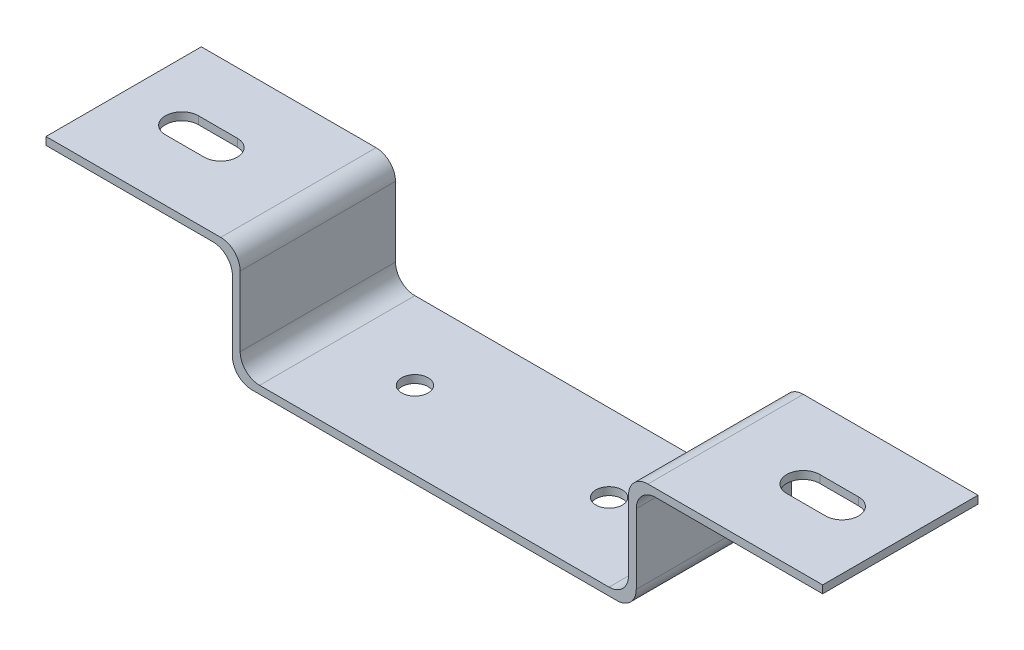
ISO-10303-21;
HEADER;
FILE_DESCRIPTION(('STEP AP214'),'2;1');
FILE_NAME('part.step','',(''),(''),'','','');
FILE_SCHEMA(('AUTOMOTIVE_DESIGN { 1 0 10303 214 1 1 1 1 }'));
ENDSEC;
DATA;
#1=APPLICATION_CONTEXT('core data for automotive mechanical design processes');
#2=APPLICATION_PROTOCOL_DEFINITION('international standard','automotive_design',2000,#1);
#3=PRODUCT_CONTEXT('',#1,'mechanical');
#4=PRODUCT('Part','Part','',(#3));
#5=PRODUCT_RELATED_PRODUCT_CATEGORY('part','',(#4));
#6=PRODUCT_DEFINITION_FORMATION('','',#4);
#7=PRODUCT_DEFINITION_CONTEXT('part definition',#1,'design');
#8=PRODUCT_DEFINITION('design','',#6,#7);
#9=PRODUCT_DEFINITION_SHAPE('','',#8);
#10=(LENGTH_UNIT() NAMED_UNIT(*) SI_UNIT(.MILLI.,.METRE.));
#11=(NAMED_UNIT(*) PLANE_ANGLE_UNIT() SI_UNIT($,.RADIAN.));
#12=(NAMED_UNIT(*) SI_UNIT($,.STERADIAN.) SOLID_ANGLE_UNIT());
#13=UNCERTAINTY_MEASURE_WITH_UNIT(LENGTH_MEASURE(1.E-05),#10,'distance_accuracy_value','');
#14=(GEOMETRIC_REPRESENTATION_CONTEXT(3) GLOBAL_UNCERTAINTY_ASSIGNED_CONTEXT((#13)) GLOBAL_UNIT_ASSIGNED_CONTEXT((#10,
#11,#12)) REPRESENTATION_CONTEXT('',''));
#15=CARTESIAN_POINT('',(0.,0.,0.));
#16=DIRECTION('',(0.,0.,1.));
#17=DIRECTION('',(1.,0.,0.));
#18=AXIS2_PLACEMENT_3D('',#15,#16,#17);
#19=CARTESIAN_POINT('',(0.,0.,40.));
#20=DIRECTION('',(1.,0.,0.));
#21=DIRECTION('',(0.,0.,-1.));
#22=AXIS2_PLACEMENT_3D('',#19,#20,#21);
#23=PLANE('',#22);
#24=DIRECTION('',(0.,-1.,0.));
#25=VECTOR('',#24,1.);
#26=CARTESIAN_POINT('',(0.,0.,0.));
#27=LINE('',#26,#25);
#28=CARTESIAN_POINT('',(0.,0.,0.));
#29=VERTEX_POINT('',#28);
#30=CARTESIAN_POINT('',(0.,-2.,0.));
#31=VERTEX_POINT('',#30);
#32=EDGE_CURVE('E285',#29,#31,#27,.T.);
#33=ORIENTED_EDGE('',*,*,#32,.T.);
#34=DIRECTION('',(0.,0.,-1.));
#35=VECTOR('',#34,1.);
#36=CARTESIAN_POINT('',(0.,-2.,40.));
#37=LINE('',#36,#35);
#38=CARTESIAN_POINT('',(0.,-2.,40.));
#39=VERTEX_POINT('',#38);
#40=EDGE_CURVE('E11',#39,#31,#37,.T.);
#41=ORIENTED_EDGE('',*,*,#40,.F.);
#42=DIRECTION('',(0.,-1.,0.));
#43=VECTOR('',#42,1.);
#44=CARTESIAN_POINT('',(0.,0.,40.));
#45=LINE('',#44,#43);
#46=CARTESIAN_POINT('',(0.,0.,40.));
#47=VERTEX_POINT('',#46);
#48=EDGE_CURVE('E286',#47,#39,#45,.T.);
#49=ORIENTED_EDGE('',*,*,#48,.F.);
#50=DIRECTION('',(0.,0.,-1.));
#51=VECTOR('',#50,1.);
#52=CARTESIAN_POINT('',(0.,0.,40.));
#53=LINE('',#52,#51);
#54=EDGE_CURVE('E328',#47,#29,#53,.T.);
#55=ORIENTED_EDGE('',*,*,#54,.T.);
#56=EDGE_LOOP('',(#33,#41,#49,#55));
#57=FACE_BOUND('',#56,.T.);
#58=ADVANCED_FACE('F33',(#57),#23,.F.);
#59=CARTESIAN_POINT('',(0.,-2.,40.));
#60=DIRECTION('',(0.,1.,0.));
#61=DIRECTION('',(0.,0.,1.));
#62=AXIS2_PLACEMENT_3D('',#59,#60,#61);
#63=PLANE('',#62);
#64=DIRECTION('',(-1.,0.,0.));
#65=VECTOR('',#64,1.);
#66=CARTESIAN_POINT('',(25.,-2.,24.25));
#67=LINE('',#66,#65);
#68=CARTESIAN_POINT('',(25.,-2.,24.2499999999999));
#69=VERTEX_POINT('',#68);
#70=CARTESIAN_POINT('',(15.,-2.,24.2499999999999));
#71=VERTEX_POINT('',#70);
#72=EDGE_CURVE('E240',#69,#71,#67,.T.);
#73=ORIENTED_EDGE('',*,*,#72,.F.);
#74=CARTESIAN_POINT('',(25.,-2.,19.9999999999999));
#75=DIRECTION('',(0.,-1.,0.));
#76=DIRECTION('',(0.,0.,-1.));
#77=AXIS2_PLACEMENT_3D('',#74,#75,#76);
#78=CIRCLE('',#77,4.25);
#79=CARTESIAN_POINT('',(25.,-2.,15.7499999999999));
#80=VERTEX_POINT('',#79);
#81=EDGE_CURVE('E48',#80,#69,#78,.T.);
#82=ORIENTED_EDGE('',*,*,#81,.F.);
#83=DIRECTION('',(1.,0.,0.));
#84=VECTOR('',#83,1.);
#85=CARTESIAN_POINT('',(25.,-2.,15.7499999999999));
#86=LINE('',#85,#84);
#87=CARTESIAN_POINT('',(15.,-2.,15.7499999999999));
#88=VERTEX_POINT('',#87);
#89=EDGE_CURVE('E226',#88,#80,#86,.T.);
#90=ORIENTED_EDGE('',*,*,#89,.F.);
#91=CARTESIAN_POINT('',(15.,-2.,19.9999999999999));
#92=DIRECTION('',(0.,-1.,0.));
#93=DIRECTION('',(0.,0.,-1.));
#94=AXIS2_PLACEMENT_3D('',#91,#92,#93);
#95=CIRCLE('',#94,4.25);
#96=EDGE_CURVE('E246',#71,#88,#95,.T.);
#97=ORIENTED_EDGE('',*,*,#96,.F.);
#98=EDGE_LOOP('',(#73,#82,#90,#97));
#99=FACE_BOUND('',#98,.T.);
#100=DIRECTION('',(1.,0.,0.));
#101=VECTOR('',#100,1.);
#102=CARTESIAN_POINT('',(0.,-2.,0.));
#103=LINE('',#102,#101);
#104=CARTESIAN_POINT('',(43.,-2.,0.));
#105=VERTEX_POINT('',#104);
#106=EDGE_CURVE('E331',#31,#105,#103,.T.);
#107=ORIENTED_EDGE('',*,*,#106,.T.);
#108=DIRECTION('',(0.,0.,-1.));
#109=VECTOR('',#108,1.);
#110=CARTESIAN_POINT('',(43.,-2.,40.));
#111=LINE('',#110,#109);
#112=CARTESIAN_POINT('',(43.,-2.,40.));
#113=VERTEX_POINT('',#112);
#114=EDGE_CURVE('E41',#113,#105,#111,.T.);
#115=ORIENTED_EDGE('',*,*,#114,.F.);
#116=DIRECTION('',(1.,0.,0.));
#117=VECTOR('',#116,1.);
#118=CARTESIAN_POINT('',(0.,-2.,40.));
#119=LINE('',#118,#117);
#120=EDGE_CURVE('E289',#39,#113,#119,.T.);
#121=ORIENTED_EDGE('',*,*,#120,.F.);
#122=ORIENTED_EDGE('',*,*,#40,.T.);
#123=EDGE_LOOP('',(#107,#115,#121,#122));
#124=FACE_BOUND('',#123,.T.);
#125=ADVANCED_FACE('F449',(#99,#124),#63,.F.);
#126=CARTESIAN_POINT('',(43.,-7.,40.));
#127=DIRECTION('',(0.,0.,-1.));
#128=DIRECTION('',(-1.,0.,0.));
#129=AXIS2_PLACEMENT_3D('',#126,#127,#128);
#130=CYLINDRICAL_SURFACE('',#129,5.);
#131=CARTESIAN_POINT('',(43.,-7.,0.));
#132=DIRECTION('',(0.,0.,-1.));
#133=DIRECTION('',(-1.,0.,0.));
#134=AXIS2_PLACEMENT_3D('',#131,#132,#133);
#135=CIRCLE('',#134,5.);
#136=CARTESIAN_POINT('',(48.,-7.,0.));
#137=VERTEX_POINT('',#136);
#138=EDGE_CURVE('E333',#105,#137,#135,.T.);
#139=ORIENTED_EDGE('',*,*,#138,.T.);
#140=DIRECTION('',(0.,0.,-1.));
#141=VECTOR('',#140,1.);
#142=CARTESIAN_POINT('',(48.,-7.,40.));
#143=LINE('',#142,#141);
#144=CARTESIAN_POINT('',(48.,-7.,40.));
#145=VERTEX_POINT('',#144);
#146=EDGE_CURVE('E418',#145,#137,#143,.T.);
#147=ORIENTED_EDGE('',*,*,#146,.F.);
#148=CARTESIAN_POINT('',(43.,-7.,40.));
#149=DIRECTION('',(0.,0.,-1.));
#150=DIRECTION('',(-1.,0.,0.));
#151=AXIS2_PLACEMENT_3D('',#148,#149,#150);
#152=CIRCLE('',#151,5.);
#153=EDGE_CURVE('E292',#113,#145,#152,.T.);
#154=ORIENTED_EDGE('',*,*,#153,.F.);
#155=ORIENTED_EDGE('',*,*,#114,.T.);
#156=EDGE_LOOP('',(#139,#147,#154,#155));
#157=FACE_BOUND('',#156,.T.);
#158=ADVANCED_FACE('F426',(#157),#130,.F.);
#159=CARTESIAN_POINT('',(48.,-7.,40.));
#160=DIRECTION('',(1.,0.,0.));
#161=DIRECTION('',(0.,0.,-1.));
#162=AXIS2_PLACEMENT_3D('',#159,#160,#161);
#163=PLANE('',#162);
#164=DIRECTION('',(0.,-1.,0.));
#165=VECTOR('',#164,1.);
#166=CARTESIAN_POINT('',(48.,-7.,0.));
#167=LINE('',#166,#165);
#168=CARTESIAN_POINT('',(48.,-25.,0.));
#169=VERTEX_POINT('',#168);
#170=EDGE_CURVE('E335',#137,#169,#167,.T.);
#171=ORIENTED_EDGE('',*,*,#170,.T.);
#172=DIRECTION('',(0.,0.,-1.));
#173=VECTOR('',#172,1.);
#174=CARTESIAN_POINT('',(48.,-25.,40.));
#175=LINE('',#174,#173);
#176=CARTESIAN_POINT('',(48.,-25.,40.));
#177=VERTEX_POINT('',#176);
#178=EDGE_CURVE('E415',#177,#169,#175,.T.);
#179=ORIENTED_EDGE('',*,*,#178,.F.);
#180=DIRECTION('',(0.,-1.,0.));
#181=VECTOR('',#180,1.);
#182=CARTESIAN_POINT('',(48.,-7.,40.));
#183=LINE('',#182,#181);
#184=EDGE_CURVE('E294',#145,#177,#183,.T.);
#185=ORIENTED_EDGE('',*,*,#184,.F.);
#186=ORIENTED_EDGE('',*,*,#146,.T.);
#187=EDGE_LOOP('',(#171,#179,#185,#186));
#188=FACE_BOUND('',#187,.T.);
#189=ADVANCED_FACE('F437',(#188),#163,.F.);
#190=CARTESIAN_POINT('',(53.,-25.,40.));
#191=DIRECTION('',(0.,0.,-1.));
#192=DIRECTION('',(-1.,0.,0.));
#193=AXIS2_PLACEMENT_3D('',#190,#191,#192);
#194=CYLINDRICAL_SURFACE('',#193,5.);
#195=CARTESIAN_POINT('',(53.,-25.,0.));
#196=DIRECTION('',(0.,0.,1.));
#197=DIRECTION('',(1.,0.,0.));
#198=AXIS2_PLACEMENT_3D('',#195,#196,#197);
#199=CIRCLE('',#198,5.);
#200=CARTESIAN_POINT('',(53.,-30.,0.));
#201=VERTEX_POINT('',#200);
#202=EDGE_CURVE('E337',#169,#201,#199,.T.);
#203=ORIENTED_EDGE('',*,*,#202,.T.);
#204=DIRECTION('',(0.,0.,-1.));
#205=VECTOR('',#204,1.);
#206=CARTESIAN_POINT('',(53.,-30.,40.));
#207=LINE('',#206,#205);
#208=CARTESIAN_POINT('',(53.,-30.,40.));
#209=VERTEX_POINT('',#208);
#210=EDGE_CURVE('E412',#209,#201,#207,.T.);
#211=ORIENTED_EDGE('',*,*,#210,.F.);
#212=CARTESIAN_POINT('',(53.,-25.,40.));
#213=DIRECTION('',(0.,0.,1.));
#214=DIRECTION('',(1.,0.,0.));
#215=AXIS2_PLACEMENT_3D('',#212,#213,#214);
#216=CIRCLE('',#215,5.);
#217=EDGE_CURVE('E296',#177,#209,#216,.T.);
#218=ORIENTED_EDGE('',*,*,#217,.F.);
#219=ORIENTED_EDGE('',*,*,#178,.T.);
#220=EDGE_LOOP('',(#203,#211,#218,#219));
#221=FACE_BOUND('',#220,.T.);
#222=ADVANCED_FACE('F441',(#221),#194,.T.);
#223=CARTESIAN_POINT('',(53.,-30.,40.));
#224=DIRECTION('',(0.,1.,0.));
#225=DIRECTION('',(-1.,0.,0.));
#226=AXIS2_PLACEMENT_3D('',#223,#224,#225);
#227=PLANE('',#226);
#228=CARTESIAN_POINT('',(75.,-30.,20.));
#229=DIRECTION('',(0.,-1.,0.));
#230=DIRECTION('',(0.,0.,-1.));
#231=AXIS2_PLACEMENT_3D('',#228,#229,#230);
#232=CIRCLE('',#231,3.4);
#233=CARTESIAN_POINT('',(75.,-30.,16.6));
#234=VERTEX_POINT('',#233);
#235=EDGE_CURVE('E791',#234,#234,#232,.T.);
#236=ORIENTED_EDGE('',*,*,#235,.F.);
#237=EDGE_LOOP('',(#236));
#238=FACE_BOUND('',#237,.T.);
#239=CARTESIAN_POINT('',(125.,-30.,20.));
#240=DIRECTION('',(0.,-1.,0.));
#241=DIRECTION('',(0.,0.,-1.));
#242=AXIS2_PLACEMENT_3D('',#239,#240,#241);
#243=CIRCLE('',#242,3.39999999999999);
#244=CARTESIAN_POINT('',(125.,-30.,16.6));
#245=VERTEX_POINT('',#244);
#246=EDGE_CURVE('E795',#245,#245,#243,.T.);
#247=ORIENTED_EDGE('',*,*,#246,.F.);
#248=EDGE_LOOP('',(#247));
#249=FACE_BOUND('',#248,.T.);
#250=DIRECTION('',(1.,0.,0.));
#251=VECTOR('',#250,1.);
#252=CARTESIAN_POINT('',(53.,-30.,0.));
#253=LINE('',#252,#251);
#254=CARTESIAN_POINT('',(147.,-30.,0.));
#255=VERTEX_POINT('',#254);
#256=EDGE_CURVE('E339',#201,#255,#253,.T.);
#257=ORIENTED_EDGE('',*,*,#256,.T.);
#258=DIRECTION('',(0.,0.,-1.));
#259=VECTOR('',#258,1.);
#260=CARTESIAN_POINT('',(147.,-30.,40.));
#261=LINE('',#260,#259);
#262=CARTESIAN_POINT('',(147.,-30.,40.));
#263=VERTEX_POINT('',#262);
#264=EDGE_CURVE('E409',#263,#255,#261,.T.);
#265=ORIENTED_EDGE('',*,*,#264,.F.);
#266=DIRECTION('',(1.,0.,0.));
#267=VECTOR('',#266,1.);
#268=CARTESIAN_POINT('',(53.,-30.,40.));
#269=LINE('',#268,#267);
#270=EDGE_CURVE('E298',#209,#263,#269,.T.);
#271=ORIENTED_EDGE('',*,*,#270,.F.);
#272=ORIENTED_EDGE('',*,*,#210,.T.);
#273=EDGE_LOOP('',(#257,#265,#271,#272));
#274=FACE_BOUND('',#273,.T.);
#275=ADVANCED_FACE('F520',(#238,#249,#274),#227,.F.);
#276=CARTESIAN_POINT('',(147.,-25.,40.));
#277=DIRECTION('',(0.,0.,-1.));
#278=DIRECTION('',(-1.,0.,0.));
#279=AXIS2_PLACEMENT_3D('',#276,#277,#278);
#280=CYLINDRICAL_SURFACE('',#279,5.);
#281=CARTESIAN_POINT('',(147.,-25.,0.));
#282=DIRECTION('',(0.,0.,1.));
#283=DIRECTION('',(1.,0.,0.));
#284=AXIS2_PLACEMENT_3D('',#281,#282,#283);
#285=CIRCLE('',#284,5.);
#286=CARTESIAN_POINT('',(152.,-25.,0.));
#287=VERTEX_POINT('',#286);
#288=EDGE_CURVE('E341',#255,#287,#285,.T.);
#289=ORIENTED_EDGE('',*,*,#288,.T.);
#290=DIRECTION('',(0.,0.,-1.));
#291=VECTOR('',#290,1.);
#292=CARTESIAN_POINT('',(152.,-25.,40.));
#293=LINE('',#292,#291);
#294=CARTESIAN_POINT('',(152.,-25.,40.));
#295=VERTEX_POINT('',#294);
#296=EDGE_CURVE('E406',#295,#287,#293,.T.);
#297=ORIENTED_EDGE('',*,*,#296,.F.);
#298=CARTESIAN_POINT('',(147.,-25.,40.));
#299=DIRECTION('',(0.,0.,1.));
#300=DIRECTION('',(1.,0.,0.));
#301=AXIS2_PLACEMENT_3D('',#298,#299,#300);
#302=CIRCLE('',#301,5.);
#303=EDGE_CURVE('E300',#263,#295,#302,.T.);
#304=ORIENTED_EDGE('',*,*,#303,.F.);
#305=ORIENTED_EDGE('',*,*,#264,.T.);
#306=EDGE_LOOP('',(#289,#297,#304,#305));
#307=FACE_BOUND('',#306,.T.);
#308=ADVANCED_FACE('F518',(#307),#280,.T.);
#309=CARTESIAN_POINT('',(152.,-25.,40.));
#310=DIRECTION('',(-1.,0.,0.));
#311=DIRECTION('',(0.,0.,1.));
#312=AXIS2_PLACEMENT_3D('',#309,#310,#311);
#313=PLANE('',#312);
#314=DIRECTION('',(0.,1.,0.));
#315=VECTOR('',#314,1.);
#316=CARTESIAN_POINT('',(152.,-25.,0.));
#317=LINE('',#316,#315);
#318=CARTESIAN_POINT('',(152.,-7.,0.));
#319=VERTEX_POINT('',#318);
#320=EDGE_CURVE('E343',#287,#319,#317,.T.);
#321=ORIENTED_EDGE('',*,*,#320,.T.);
#322=DIRECTION('',(0.,0.,-1.));
#323=VECTOR('',#322,1.);
#324=CARTESIAN_POINT('',(152.,-7.,40.));
#325=LINE('',#324,#323);
#326=CARTESIAN_POINT('',(152.,-7.,40.));
#327=VERTEX_POINT('',#326);
#328=EDGE_CURVE('E403',#327,#319,#325,.T.);
#329=ORIENTED_EDGE('',*,*,#328,.F.);
#330=DIRECTION('',(0.,1.,0.));
#331=VECTOR('',#330,1.);
#332=CARTESIAN_POINT('',(152.,-25.,40.));
#333=LINE('',#332,#331);
#334=EDGE_CURVE('E302',#295,#327,#333,.T.);
#335=ORIENTED_EDGE('',*,*,#334,.F.);
#336=ORIENTED_EDGE('',*,*,#296,.T.);
#337=EDGE_LOOP('',(#321,#329,#335,#336));
#338=FACE_BOUND('',#337,.T.);
#339=ADVANCED_FACE('F513',(#338),#313,.F.);
#340=CARTESIAN_POINT('',(157.,-7.,40.));
#341=DIRECTION('',(0.,0.,-1.));
#342=DIRECTION('',(-1.,0.,0.));
#343=AXIS2_PLACEMENT_3D('',#340,#341,#342);
#344=CYLINDRICAL_SURFACE('',#343,5.);
#345=CARTESIAN_POINT('',(157.,-7.,0.));
#346=DIRECTION('',(0.,0.,-1.));
#347=DIRECTION('',(1.,0.,0.));
#348=AXIS2_PLACEMENT_3D('',#345,#346,#347);
#349=CIRCLE('',#348,5.);
#350=CARTESIAN_POINT('',(157.,-2.,0.));
#351=VERTEX_POINT('',#350);
#352=EDGE_CURVE('E345',#319,#351,#349,.T.);
#353=ORIENTED_EDGE('',*,*,#352,.T.);
#354=DIRECTION('',(0.,0.,-1.));
#355=VECTOR('',#354,1.);
#356=CARTESIAN_POINT('',(157.,-2.,40.));
#357=LINE('',#356,#355);
#358=CARTESIAN_POINT('',(157.,-2.,40.));
#359=VERTEX_POINT('',#358);
#360=EDGE_CURVE('E400',#359,#351,#357,.T.);
#361=ORIENTED_EDGE('',*,*,#360,.F.);
#362=CARTESIAN_POINT('',(157.,-7.,40.));
#363=DIRECTION('',(0.,0.,-1.));
#364=DIRECTION('',(1.,0.,0.));
#365=AXIS2_PLACEMENT_3D('',#362,#363,#364);
#366=CIRCLE('',#365,5.);
#367=EDGE_CURVE('E304',#327,#359,#366,.T.);
#368=ORIENTED_EDGE('',*,*,#367,.F.);
#369=ORIENTED_EDGE('',*,*,#328,.T.);
#370=EDGE_LOOP('',(#353,#361,#368,#369));
#371=FACE_BOUND('',#370,.T.);
#372=ADVANCED_FACE('F508',(#371),#344,.F.);
#373=CARTESIAN_POINT('',(157.,-2.,40.));
#374=DIRECTION('',(0.,1.,0.));
#375=DIRECTION('',(0.,0.,1.));
#376=AXIS2_PLACEMENT_3D('',#373,#374,#375);
#377=PLANE('',#376);
#378=DIRECTION('',(-1.,0.,0.));
#379=VECTOR('',#378,1.);
#380=CARTESIAN_POINT('',(185.,-2.,24.25));
#381=LINE('',#380,#379);
#382=CARTESIAN_POINT('',(185.,-2.,24.25));
#383=VERTEX_POINT('',#382);
#384=CARTESIAN_POINT('',(175.,-2.,24.25));
#385=VERTEX_POINT('',#384);
#386=EDGE_CURVE('E264',#383,#385,#381,.T.);
#387=ORIENTED_EDGE('',*,*,#386,.F.);
#388=CARTESIAN_POINT('',(185.,-2.,20.));
#389=DIRECTION('',(0.,-1.,0.));
#390=DIRECTION('',(0.,0.,-1.));
#391=AXIS2_PLACEMENT_3D('',#388,#389,#390);
#392=CIRCLE('',#391,4.25);
#393=CARTESIAN_POINT('',(185.,-2.,15.75));
#394=VERTEX_POINT('',#393);
#395=EDGE_CURVE('E262',#394,#383,#392,.T.);
#396=ORIENTED_EDGE('',*,*,#395,.F.);
#397=DIRECTION('',(1.,0.,0.));
#398=VECTOR('',#397,1.);
#399=CARTESIAN_POINT('',(185.,-2.,15.75));
#400=LINE('',#399,#398);
#401=CARTESIAN_POINT('',(175.,-2.,15.75));
#402=VERTEX_POINT('',#401);
#403=EDGE_CURVE('E270',#402,#394,#400,.T.);
#404=ORIENTED_EDGE('',*,*,#403,.F.);
#405=CARTESIAN_POINT('',(175.,-2.,20.));
#406=DIRECTION('',(0.,-1.,0.));
#407=DIRECTION('',(0.,0.,-1.));
#408=AXIS2_PLACEMENT_3D('',#405,#406,#407);
#409=CIRCLE('',#408,4.25);
#410=EDGE_CURVE('E267',#385,#402,#409,.T.);
#411=ORIENTED_EDGE('',*,*,#410,.F.);
#412=EDGE_LOOP('',(#387,#396,#404,#411));
#413=FACE_BOUND('',#412,.T.);
#414=DIRECTION('',(1.,0.,0.));
#415=VECTOR('',#414,1.);
#416=CARTESIAN_POINT('',(157.,-2.,0.));
#417=LINE('',#416,#415);
#418=CARTESIAN_POINT('',(200.,-2.,0.));
#419=VERTEX_POINT('',#418);
#420=EDGE_CURVE('E347',#351,#419,#417,.T.);
#421=ORIENTED_EDGE('',*,*,#420,.T.);
#422=DIRECTION('',(0.,0.,-1.));
#423=VECTOR('',#422,1.);
#424=CARTESIAN_POINT('',(200.,-2.,40.));
#425=LINE('',#424,#423);
#426=CARTESIAN_POINT('',(200.,-2.,40.));
#427=VERTEX_POINT('',#426);
#428=EDGE_CURVE('E397',#427,#419,#425,.T.);
#429=ORIENTED_EDGE('',*,*,#428,.F.);
#430=DIRECTION('',(1.,0.,0.));
#431=VECTOR('',#430,1.);
#432=CARTESIAN_POINT('',(157.,-2.,40.));
#433=LINE('',#432,#431);
#434=EDGE_CURVE('E306',#359,#427,#433,.T.);
#435=ORIENTED_EDGE('',*,*,#434,.F.);
#436=ORIENTED_EDGE('',*,*,#360,.T.);
#437=EDGE_LOOP('',(#421,#429,#435,#436));
#438=FACE_BOUND('',#437,.T.);
#439=ADVANCED_FACE('F504',(#413,#438),#377,.F.);
#440=CARTESIAN_POINT('',(200.,0.,40.));
#441=DIRECTION('',(-1.,0.,0.));
#442=DIRECTION('',(0.,0.,1.));
#443=AXIS2_PLACEMENT_3D('',#440,#441,#442);
#444=PLANE('',#443);
#445=DIRECTION('',(0.,1.,0.));
#446=VECTOR('',#445,1.);
#447=CARTESIAN_POINT('',(200.,0.,0.));
#448=LINE('',#447,#446);
#449=CARTESIAN_POINT('',(200.,0.,0.));
#450=VERTEX_POINT('',#449);
#451=EDGE_CURVE('E349',#419,#450,#448,.T.);
#452=ORIENTED_EDGE('',*,*,#451,.T.);
#453=DIRECTION('',(0.,0.,-1.));
#454=VECTOR('',#453,1.);
#455=CARTESIAN_POINT('',(200.,0.,40.));
#456=LINE('',#455,#454);
#457=CARTESIAN_POINT('',(200.,0.,40.));
#458=VERTEX_POINT('',#457);
#459=EDGE_CURVE('E394',#458,#450,#456,.T.);
#460=ORIENTED_EDGE('',*,*,#459,.F.);
#461=DIRECTION('',(0.,1.,0.));
#462=VECTOR('',#461,1.);
#463=CARTESIAN_POINT('',(200.,0.,40.));
#464=LINE('',#463,#462);
#465=EDGE_CURVE('E308',#427,#458,#464,.T.);
#466=ORIENTED_EDGE('',*,*,#465,.F.);
#467=ORIENTED_EDGE('',*,*,#428,.T.);
#468=EDGE_LOOP('',(#452,#460,#466,#467));
#469=FACE_BOUND('',#468,.T.);
#470=ADVANCED_FACE('F499',(#469),#444,.F.);
#471=CARTESIAN_POINT('',(155.,0.,40.));
#472=DIRECTION('',(0.,-1.,0.));
#473=DIRECTION('',(0.,0.,-1.));
#474=AXIS2_PLACEMENT_3D('',#471,#472,#473);
#475=PLANE('',#474);
#476=DIRECTION('',(-1.,0.,0.));
#477=VECTOR('',#476,1.);
#478=CARTESIAN_POINT('',(185.,0.,15.75));
#479=LINE('',#478,#477);
#480=CARTESIAN_POINT('',(185.,0.,15.75));
#481=VERTEX_POINT('',#480);
#482=CARTESIAN_POINT('',(175.,0.,15.75));
#483=VERTEX_POINT('',#482);
#484=EDGE_CURVE('E256',#481,#483,#479,.T.);
#485=ORIENTED_EDGE('',*,*,#484,.F.);
#486=CARTESIAN_POINT('',(185.,0.,20.));
#487=DIRECTION('',(0.,-1.,0.));
#488=DIRECTION('',(0.,0.,-1.));
#489=AXIS2_PLACEMENT_3D('',#486,#487,#488);
#490=CIRCLE('',#489,4.25);
#491=CARTESIAN_POINT('',(185.,0.,24.25));
#492=VERTEX_POINT('',#491);
#493=EDGE_CURVE('E259',#492,#481,#490,.F.);
#494=ORIENTED_EDGE('',*,*,#493,.F.);
#495=DIRECTION('',(1.,0.,0.));
#496=VECTOR('',#495,1.);
#497=CARTESIAN_POINT('',(185.,0.,24.25));
#498=LINE('',#497,#496);
#499=CARTESIAN_POINT('',(175.,0.,24.25));
#500=VERTEX_POINT('',#499);
#501=EDGE_CURVE('E276',#500,#492,#498,.T.);
#502=ORIENTED_EDGE('',*,*,#501,.F.);
#503=CARTESIAN_POINT('',(175.,0.,20.));
#504=DIRECTION('',(0.,-1.,0.));
#505=DIRECTION('',(0.,0.,-1.));
#506=AXIS2_PLACEMENT_3D('',#503,#504,#505);
#507=CIRCLE('',#506,4.25);
#508=EDGE_CURVE('E232',#483,#500,#507,.F.);
#509=ORIENTED_EDGE('',*,*,#508,.F.);
#510=EDGE_LOOP('',(#485,#494,#502,#509));
#511=FACE_BOUND('',#510,.T.);
#512=DIRECTION('',(-1.,0.,0.));
#513=VECTOR('',#512,1.);
#514=CARTESIAN_POINT('',(155.,0.,0.));
#515=LINE('',#514,#513);
#516=CARTESIAN_POINT('',(155.,0.,0.));
#517=VERTEX_POINT('',#516);
#518=EDGE_CURVE('E351',#450,#517,#515,.T.);
#519=ORIENTED_EDGE('',*,*,#518,.T.);
#520=DIRECTION('',(0.,0.,-1.));
#521=VECTOR('',#520,1.);
#522=CARTESIAN_POINT('',(155.,0.,40.));
#523=LINE('',#522,#521);
#524=CARTESIAN_POINT('',(155.,0.,40.));
#525=VERTEX_POINT('',#524);
#526=EDGE_CURVE('E391',#525,#517,#523,.T.);
#527=ORIENTED_EDGE('',*,*,#526,.F.);
#528=DIRECTION('',(-1.,0.,0.));
#529=VECTOR('',#528,1.);
#530=CARTESIAN_POINT('',(155.,0.,40.));
#531=LINE('',#530,#529);
#532=EDGE_CURVE('E310',#458,#525,#531,.T.);
#533=ORIENTED_EDGE('',*,*,#532,.F.);
#534=ORIENTED_EDGE('',*,*,#459,.T.);
#535=EDGE_LOOP('',(#519,#527,#533,#534));
#536=FACE_BOUND('',#535,.T.);
#537=ADVANCED_FACE('F493',(#511,#536),#475,.F.);
#538=CARTESIAN_POINT('',(155.,-5.,40.));
#539=DIRECTION('',(0.,0.,-1.));
#540=DIRECTION('',(-1.,0.,0.));
#541=AXIS2_PLACEMENT_3D('',#538,#539,#540);
#542=CYLINDRICAL_SURFACE('',#541,5.);
#543=CARTESIAN_POINT('',(155.,-5.,0.));
#544=DIRECTION('',(0.,0.,1.));
#545=DIRECTION('',(-1.,0.,0.));
#546=AXIS2_PLACEMENT_3D('',#543,#544,#545);
#547=CIRCLE('',#546,5.);
#548=CARTESIAN_POINT('',(150.,-5.,0.));
#549=VERTEX_POINT('',#548);
#550=EDGE_CURVE('E353',#517,#549,#547,.T.);
#551=ORIENTED_EDGE('',*,*,#550,.T.);
#552=DIRECTION('',(0.,0.,-1.));
#553=VECTOR('',#552,1.);
#554=CARTESIAN_POINT('',(150.,-5.,40.));
#555=LINE('',#554,#553);
#556=CARTESIAN_POINT('',(150.,-5.,40.));
#557=VERTEX_POINT('',#556);
#558=EDGE_CURVE('E388',#557,#549,#555,.T.);
#559=ORIENTED_EDGE('',*,*,#558,.F.);
#560=CARTESIAN_POINT('',(155.,-5.,40.));
#561=DIRECTION('',(0.,0.,1.));
#562=DIRECTION('',(-1.,0.,0.));
#563=AXIS2_PLACEMENT_3D('',#560,#561,#562);
#564=CIRCLE('',#563,5.);
#565=EDGE_CURVE('E312',#525,#557,#564,.T.);
#566=ORIENTED_EDGE('',*,*,#565,.F.);
#567=ORIENTED_EDGE('',*,*,#526,.T.);
#568=EDGE_LOOP('',(#551,#559,#566,#567));
#569=FACE_BOUND('',#568,.T.);
#570=ADVANCED_FACE('F489',(#569),#542,.T.);
#571=CARTESIAN_POINT('',(150.,-23.,40.));
#572=DIRECTION('',(1.,0.,0.));
#573=DIRECTION('',(0.,0.,-1.));
#574=AXIS2_PLACEMENT_3D('',#571,#572,#573);
#575=PLANE('',#574);
#576=DIRECTION('',(0.,-1.,0.));
#577=VECTOR('',#576,1.);
#578=CARTESIAN_POINT('',(150.,-23.,0.));
#579=LINE('',#578,#577);
#580=CARTESIAN_POINT('',(150.,-23.,0.));
#581=VERTEX_POINT('',#580);
#582=EDGE_CURVE('E355',#549,#581,#579,.T.);
#583=ORIENTED_EDGE('',*,*,#582,.T.);
#584=DIRECTION('',(0.,0.,-1.));
#585=VECTOR('',#584,1.);
#586=CARTESIAN_POINT('',(150.,-23.,40.));
#587=LINE('',#586,#585);
#588=CARTESIAN_POINT('',(150.,-23.,40.));
#589=VERTEX_POINT('',#588);
#590=EDGE_CURVE('E385',#589,#581,#587,.T.);
#591=ORIENTED_EDGE('',*,*,#590,.F.);
#592=DIRECTION('',(0.,-1.,0.));
#593=VECTOR('',#592,1.);
#594=CARTESIAN_POINT('',(150.,-23.,40.));
#595=LINE('',#594,#593);
#596=EDGE_CURVE('E314',#557,#589,#595,.T.);
#597=ORIENTED_EDGE('',*,*,#596,.F.);
#598=ORIENTED_EDGE('',*,*,#558,.T.);
#599=EDGE_LOOP('',(#583,#591,#597,#598));
#600=FACE_BOUND('',#599,.T.);
#601=ADVANCED_FACE('F484',(#600),#575,.F.);
#602=CARTESIAN_POINT('',(145.,-23.,40.));
#603=DIRECTION('',(0.,0.,-1.));
#604=DIRECTION('',(-1.,0.,0.));
#605=AXIS2_PLACEMENT_3D('',#602,#603,#604);
#606=CYLINDRICAL_SURFACE('',#605,5.);
#607=CARTESIAN_POINT('',(145.,-23.,0.));
#608=DIRECTION('',(0.,0.,-1.));
#609=DIRECTION('',(-1.,0.,0.));
#610=AXIS2_PLACEMENT_3D('',#607,#608,#609);
#611=CIRCLE('',#610,5.);
#612=CARTESIAN_POINT('',(145.,-28.,0.));
#613=VERTEX_POINT('',#612);
#614=EDGE_CURVE('E357',#581,#613,#611,.T.);
#615=ORIENTED_EDGE('',*,*,#614,.T.);
#616=DIRECTION('',(0.,0.,-1.));
#617=VECTOR('',#616,1.);
#618=CARTESIAN_POINT('',(145.,-28.,40.));
#619=LINE('',#618,#617);
#620=CARTESIAN_POINT('',(145.,-28.,40.));
#621=VERTEX_POINT('',#620);
#622=EDGE_CURVE('E382',#621,#613,#619,.T.);
#623=ORIENTED_EDGE('',*,*,#622,.F.);
#624=CARTESIAN_POINT('',(145.,-23.,40.));
#625=DIRECTION('',(0.,0.,-1.));
#626=DIRECTION('',(-1.,0.,0.));
#627=AXIS2_PLACEMENT_3D('',#624,#625,#626);
#628=CIRCLE('',#627,5.);
#629=EDGE_CURVE('E316',#589,#621,#628,.T.);
#630=ORIENTED_EDGE('',*,*,#629,.F.);
#631=ORIENTED_EDGE('',*,*,#590,.T.);
#632=EDGE_LOOP('',(#615,#623,#630,#631));
#633=FACE_BOUND('',#632,.T.);
#634=ADVANCED_FACE('F478',(#633),#606,.F.);
#635=CARTESIAN_POINT('',(55.,-28.,40.));
#636=DIRECTION('',(0.,-1.,0.));
#637=DIRECTION('',(0.,0.,-1.));
#638=AXIS2_PLACEMENT_3D('',#635,#636,#637);
#639=PLANE('',#638);
#640=CARTESIAN_POINT('',(75.,-28.,20.));
#641=DIRECTION('',(0.,-1.,0.));
#642=DIRECTION('',(0.,0.,-1.));
#643=AXIS2_PLACEMENT_3D('',#640,#641,#642);
#644=CIRCLE('',#643,3.4);
#645=CARTESIAN_POINT('',(75.,-28.,16.6));
#646=VERTEX_POINT('',#645);
#647=EDGE_CURVE('E794',#646,#646,#644,.T.);
#648=ORIENTED_EDGE('',*,*,#647,.T.);
#649=EDGE_LOOP('',(#648));
#650=FACE_BOUND('',#649,.T.);
#651=CARTESIAN_POINT('',(125.,-28.,20.));
#652=DIRECTION('',(0.,-1.,0.));
#653=DIRECTION('',(0.,0.,-1.));
#654=AXIS2_PLACEMENT_3D('',#651,#652,#653);
#655=CIRCLE('',#654,3.39999999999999);
#656=CARTESIAN_POINT('',(125.,-28.,16.6));
#657=VERTEX_POINT('',#656);
#658=EDGE_CURVE('E36',#657,#657,#655,.T.);
#659=ORIENTED_EDGE('',*,*,#658,.T.);
#660=EDGE_LOOP('',(#659));
#661=FACE_BOUND('',#660,.T.);
#662=DIRECTION('',(-1.,0.,0.));
#663=VECTOR('',#662,1.);
#664=CARTESIAN_POINT('',(55.,-28.,0.));
#665=LINE('',#664,#663);
#666=CARTESIAN_POINT('',(55.,-28.,0.));
#667=VERTEX_POINT('',#666);
#668=EDGE_CURVE('E359',#613,#667,#665,.T.);
#669=ORIENTED_EDGE('',*,*,#668,.T.);
#670=DIRECTION('',(0.,0.,-1.));
#671=VECTOR('',#670,1.);
#672=CARTESIAN_POINT('',(55.,-28.,40.));
#673=LINE('',#672,#671);
#674=CARTESIAN_POINT('',(55.,-28.,40.));
#675=VERTEX_POINT('',#674);
#676=EDGE_CURVE('E379',#675,#667,#673,.T.);
#677=ORIENTED_EDGE('',*,*,#676,.F.);
#678=DIRECTION('',(-1.,0.,0.));
#679=VECTOR('',#678,1.);
#680=CARTESIAN_POINT('',(55.,-28.,40.));
#681=LINE('',#680,#679);
#682=EDGE_CURVE('E318',#621,#675,#681,.T.);
#683=ORIENTED_EDGE('',*,*,#682,.F.);
#684=ORIENTED_EDGE('',*,*,#622,.T.);
#685=EDGE_LOOP('',(#669,#677,#683,#684));
#686=FACE_BOUND('',#685,.T.);
#687=ADVANCED_FACE('F474',(#650,#661,#686),#639,.F.);
#688=CARTESIAN_POINT('',(55.,-23.,40.));
#689=DIRECTION('',(0.,0.,-1.));
#690=DIRECTION('',(-1.,0.,0.));
#691=AXIS2_PLACEMENT_3D('',#688,#689,#690);
#692=CYLINDRICAL_SURFACE('',#691,5.);
#693=CARTESIAN_POINT('',(55.,-23.,0.));
#694=DIRECTION('',(0.,0.,-1.));
#695=DIRECTION('',(-1.,0.,0.));
#696=AXIS2_PLACEMENT_3D('',#693,#694,#695);
#697=CIRCLE('',#696,5.);
#698=CARTESIAN_POINT('',(50.,-23.,0.));
#699=VERTEX_POINT('',#698);
#700=EDGE_CURVE('E361',#667,#699,#697,.T.);
#701=ORIENTED_EDGE('',*,*,#700,.T.);
#702=DIRECTION('',(0.,0.,-1.));
#703=VECTOR('',#702,1.);
#704=CARTESIAN_POINT('',(50.,-23.,40.));
#705=LINE('',#704,#703);
#706=CARTESIAN_POINT('',(50.,-23.,40.));
#707=VERTEX_POINT('',#706);
#708=EDGE_CURVE('E376',#707,#699,#705,.T.);
#709=ORIENTED_EDGE('',*,*,#708,.F.);
#710=CARTESIAN_POINT('',(55.,-23.,40.));
#711=DIRECTION('',(0.,0.,-1.));
#712=DIRECTION('',(-1.,0.,0.));
#713=AXIS2_PLACEMENT_3D('',#710,#711,#712);
#714=CIRCLE('',#713,5.);
#715=EDGE_CURVE('E320',#675,#707,#714,.T.);
#716=ORIENTED_EDGE('',*,*,#715,.F.);
#717=ORIENTED_EDGE('',*,*,#676,.T.);
#718=EDGE_LOOP('',(#701,#709,#716,#717));
#719=FACE_BOUND('',#718,.T.);
#720=ADVANCED_FACE('F469',(#719),#692,.F.);
#721=CARTESIAN_POINT('',(50.,-5.,40.));
#722=DIRECTION('',(-1.,0.,0.));
#723=DIRECTION('',(0.,0.,1.));
#724=AXIS2_PLACEMENT_3D('',#721,#722,#723);
#725=PLANE('',#724);
#726=DIRECTION('',(0.,1.,0.));
#727=VECTOR('',#726,1.);
#728=CARTESIAN_POINT('',(50.,-5.,0.));
#729=LINE('',#728,#727);
#730=CARTESIAN_POINT('',(50.,-5.,0.));
#731=VERTEX_POINT('',#730);
#732=EDGE_CURVE('E363',#699,#731,#729,.T.);
#733=ORIENTED_EDGE('',*,*,#732,.T.);
#734=DIRECTION('',(0.,0.,-1.));
#735=VECTOR('',#734,1.);
#736=CARTESIAN_POINT('',(50.,-5.,40.));
#737=LINE('',#736,#735);
#738=CARTESIAN_POINT('',(50.,-5.,40.));
#739=VERTEX_POINT('',#738);
#740=EDGE_CURVE('E373',#739,#731,#737,.T.);
#741=ORIENTED_EDGE('',*,*,#740,.F.);
#742=DIRECTION('',(0.,1.,0.));
#743=VECTOR('',#742,1.);
#744=CARTESIAN_POINT('',(50.,-5.,40.));
#745=LINE('',#744,#743);
#746=EDGE_CURVE('E322',#707,#739,#745,.T.);
#747=ORIENTED_EDGE('',*,*,#746,.F.);
#748=ORIENTED_EDGE('',*,*,#708,.T.);
#749=EDGE_LOOP('',(#733,#741,#747,#748));
#750=FACE_BOUND('',#749,.T.);
#751=ADVANCED_FACE('F463',(#750),#725,.F.);
#752=CARTESIAN_POINT('',(45.,-5.,40.));
#753=DIRECTION('',(0.,0.,-1.));
#754=DIRECTION('',(-1.,0.,0.));
#755=AXIS2_PLACEMENT_3D('',#752,#753,#754);
#756=CYLINDRICAL_SURFACE('',#755,5.);
#757=CARTESIAN_POINT('',(45.,-5.,0.));
#758=DIRECTION('',(0.,0.,1.));
#759=DIRECTION('',(1.,0.,0.));
#760=AXIS2_PLACEMENT_3D('',#757,#758,#759);
#761=CIRCLE('',#760,5.);
#762=CARTESIAN_POINT('',(45.,0.,0.));
#763=VERTEX_POINT('',#762);
#764=EDGE_CURVE('E365',#731,#763,#761,.T.);
#765=ORIENTED_EDGE('',*,*,#764,.T.);
#766=DIRECTION('',(0.,0.,-1.));
#767=VECTOR('',#766,1.);
#768=CARTESIAN_POINT('',(45.,0.,40.));
#769=LINE('',#768,#767);
#770=CARTESIAN_POINT('',(45.,0.,40.));
#771=VERTEX_POINT('',#770);
#772=EDGE_CURVE('E370',#771,#763,#769,.T.);
#773=ORIENTED_EDGE('',*,*,#772,.F.);
#774=CARTESIAN_POINT('',(45.,-5.,40.));
#775=DIRECTION('',(0.,0.,1.));
#776=DIRECTION('',(1.,0.,0.));
#777=AXIS2_PLACEMENT_3D('',#774,#775,#776);
#778=CIRCLE('',#777,5.);
#779=EDGE_CURVE('E324',#739,#771,#778,.T.);
#780=ORIENTED_EDGE('',*,*,#779,.F.);
#781=ORIENTED_EDGE('',*,*,#740,.T.);
#782=EDGE_LOOP('',(#765,#773,#780,#781));
#783=FACE_BOUND('',#782,.T.);
#784=ADVANCED_FACE('F459',(#783),#756,.T.);
#785=CARTESIAN_POINT('',(0.,0.,40.));
#786=DIRECTION('',(0.,-1.,0.));
#787=DIRECTION('',(0.,0.,-1.));
#788=AXIS2_PLACEMENT_3D('',#785,#786,#787);
#789=PLANE('',#788);
#790=DIRECTION('',(-1.,0.,0.));
#791=VECTOR('',#790,1.);
#792=CARTESIAN_POINT('',(25.,0.,15.7499999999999));
#793=LINE('',#792,#791);
#794=CARTESIAN_POINT('',(25.,0.,15.7499999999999));
#795=VERTEX_POINT('',#794);
#796=CARTESIAN_POINT('',(15.,0.,15.7499999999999));
#797=VERTEX_POINT('',#796);
#798=EDGE_CURVE('E238',#795,#797,#793,.T.);
#799=ORIENTED_EDGE('',*,*,#798,.F.);
#800=CARTESIAN_POINT('',(25.,0.,19.9999999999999));
#801=DIRECTION('',(0.,-1.,0.));
#802=DIRECTION('',(0.,0.,-1.));
#803=AXIS2_PLACEMENT_3D('',#800,#801,#802);
#804=CIRCLE('',#803,4.25);
#805=CARTESIAN_POINT('',(25.,0.,24.25));
#806=VERTEX_POINT('',#805);
#807=EDGE_CURVE('E220',#806,#795,#804,.F.);
#808=ORIENTED_EDGE('',*,*,#807,.F.);
#809=DIRECTION('',(1.,0.,0.));
#810=VECTOR('',#809,1.);
#811=CARTESIAN_POINT('',(25.,0.,24.25));
#812=LINE('',#811,#810);
#813=CARTESIAN_POINT('',(15.,0.,24.2499999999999));
#814=VERTEX_POINT('',#813);
#815=EDGE_CURVE('E229',#814,#806,#812,.T.);
#816=ORIENTED_EDGE('',*,*,#815,.F.);
#817=CARTESIAN_POINT('',(15.,0.,19.9999999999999));
#818=DIRECTION('',(0.,-1.,0.));
#819=DIRECTION('',(0.,0.,-1.));
#820=AXIS2_PLACEMENT_3D('',#817,#818,#819);
#821=CIRCLE('',#820,4.25);
#822=EDGE_CURVE('E56',#797,#814,#821,.F.);
#823=ORIENTED_EDGE('',*,*,#822,.F.);
#824=EDGE_LOOP('',(#799,#808,#816,#823));
#825=FACE_BOUND('',#824,.T.);
#826=DIRECTION('',(-1.,0.,0.));
#827=VECTOR('',#826,1.);
#828=CARTESIAN_POINT('',(0.,0.,0.));
#829=LINE('',#828,#827);
#830=EDGE_CURVE('E290',#763,#29,#829,.T.);
#831=ORIENTED_EDGE('',*,*,#830,.T.);
#832=ORIENTED_EDGE('',*,*,#54,.F.);
#833=DIRECTION('',(-1.,0.,0.));
#834=VECTOR('',#833,1.);
#835=CARTESIAN_POINT('',(0.,0.,40.));
#836=LINE('',#835,#834);
#837=EDGE_CURVE('E326',#771,#47,#836,.T.);
#838=ORIENTED_EDGE('',*,*,#837,.F.);
#839=ORIENTED_EDGE('',*,*,#772,.T.);
#840=EDGE_LOOP('',(#831,#832,#838,#839));
#841=FACE_BOUND('',#840,.T.);
#842=ADVANCED_FACE('F235',(#825,#841),#789,.F.);
#843=CARTESIAN_POINT('',(43.,-7.,40.));
#844=DIRECTION('',(0.,0.,-1.));
#845=DIRECTION('',(-1.,0.,0.));
#846=AXIS2_PLACEMENT_3D('',#843,#844,#845);
#847=PLANE('',#846);
#848=ORIENTED_EDGE('',*,*,#48,.T.);
#849=ORIENTED_EDGE('',*,*,#120,.T.);
#850=ORIENTED_EDGE('',*,*,#153,.T.);
#851=ORIENTED_EDGE('',*,*,#184,.T.);
#852=ORIENTED_EDGE('',*,*,#217,.T.);
#853=ORIENTED_EDGE('',*,*,#270,.T.);
#854=ORIENTED_EDGE('',*,*,#303,.T.);
#855=ORIENTED_EDGE('',*,*,#334,.T.);
#856=ORIENTED_EDGE('',*,*,#367,.T.);
#857=ORIENTED_EDGE('',*,*,#434,.T.);
#858=ORIENTED_EDGE('',*,*,#465,.T.);
#859=ORIENTED_EDGE('',*,*,#532,.T.);
#860=ORIENTED_EDGE('',*,*,#565,.T.);
#861=ORIENTED_EDGE('',*,*,#596,.T.);
#862=ORIENTED_EDGE('',*,*,#629,.T.);
#863=ORIENTED_EDGE('',*,*,#682,.T.);
#864=ORIENTED_EDGE('',*,*,#715,.T.);
#865=ORIENTED_EDGE('',*,*,#746,.T.);
#866=ORIENTED_EDGE('',*,*,#779,.T.);
#867=ORIENTED_EDGE('',*,*,#837,.T.);
#868=EDGE_LOOP('',(#848,#849,#850,#851,#852,#853,#854,#855,#856,#857,#858,#859,#860,#861,#862,
#863,#864,#865,#866,#867));
#869=FACE_BOUND('',#868,.T.);
#870=ADVANCED_FACE('F445',(#869),#847,.F.);
#871=CARTESIAN_POINT('',(43.,-7.,0.));
#872=DIRECTION('',(0.,0.,-1.));
#873=DIRECTION('',(-1.,0.,0.));
#874=AXIS2_PLACEMENT_3D('',#871,#872,#873);
#875=PLANE('',#874);
#876=ORIENTED_EDGE('',*,*,#32,.F.);
#877=ORIENTED_EDGE('',*,*,#830,.F.);
#878=ORIENTED_EDGE('',*,*,#764,.F.);
#879=ORIENTED_EDGE('',*,*,#732,.F.);
#880=ORIENTED_EDGE('',*,*,#700,.F.);
#881=ORIENTED_EDGE('',*,*,#668,.F.);
#882=ORIENTED_EDGE('',*,*,#614,.F.);
#883=ORIENTED_EDGE('',*,*,#582,.F.);
#884=ORIENTED_EDGE('',*,*,#550,.F.);
#885=ORIENTED_EDGE('',*,*,#518,.F.);
#886=ORIENTED_EDGE('',*,*,#451,.F.);
#887=ORIENTED_EDGE('',*,*,#420,.F.);
#888=ORIENTED_EDGE('',*,*,#352,.F.);
#889=ORIENTED_EDGE('',*,*,#320,.F.);
#890=ORIENTED_EDGE('',*,*,#288,.F.);
#891=ORIENTED_EDGE('',*,*,#256,.F.);
#892=ORIENTED_EDGE('',*,*,#202,.F.);
#893=ORIENTED_EDGE('',*,*,#170,.F.);
#894=ORIENTED_EDGE('',*,*,#138,.F.);
#895=ORIENTED_EDGE('',*,*,#106,.F.);
#896=EDGE_LOOP('',(#876,#877,#878,#879,#880,#881,#882,#883,#884,#885,#886,#887,#888,#889,#890,
#891,#892,#893,#894,#895));
#897=FACE_BOUND('',#896,.T.);
#898=ADVANCED_FACE('F432',(#897),#875,.T.);
#899=CARTESIAN_POINT('',(185.,0.00100000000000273,20.));
#900=DIRECTION('',(0.,-1.,0.));
#901=DIRECTION('',(0.,0.,-1.));
#902=AXIS2_PLACEMENT_3D('',#899,#900,#901);
#903=CYLINDRICAL_SURFACE('',#902,4.25);
#904=ORIENTED_EDGE('',*,*,#493,.T.);
#905=DIRECTION('',(0.,-1.,0.));
#906=VECTOR('',#905,1.);
#907=CARTESIAN_POINT('',(185.,0.00100000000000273,15.75));
#908=LINE('',#907,#906);
#909=EDGE_CURVE('E274',#481,#394,#908,.T.);
#910=ORIENTED_EDGE('',*,*,#909,.T.);
#911=ORIENTED_EDGE('',*,*,#395,.T.);
#912=DIRECTION('',(0.,-1.,0.));
#913=VECTOR('',#912,1.);
#914=CARTESIAN_POINT('',(185.,0.00100000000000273,24.25));
#915=LINE('',#914,#913);
#916=EDGE_CURVE('E273',#492,#383,#915,.T.);
#917=ORIENTED_EDGE('',*,*,#916,.F.);
#918=EDGE_LOOP('',(#904,#910,#911,#917));
#919=FACE_BOUND('',#918,.T.);
#920=ADVANCED_FACE('F654',(#919),#903,.F.);
#921=CARTESIAN_POINT('',(185.,0.00100000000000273,15.75));
#922=DIRECTION('',(0.,0.,-1.));
#923=DIRECTION('',(-1.,0.,0.));
#924=AXIS2_PLACEMENT_3D('',#921,#922,#923);
#925=PLANE('',#924);
#926=ORIENTED_EDGE('',*,*,#484,.T.);
#927=DIRECTION('',(0.,-1.,0.));
#928=VECTOR('',#927,1.);
#929=CARTESIAN_POINT('',(175.,0.00100000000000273,15.75));
#930=LINE('',#929,#928);
#931=EDGE_CURVE('E277',#483,#402,#930,.T.);
#932=ORIENTED_EDGE('',*,*,#931,.T.);
#933=ORIENTED_EDGE('',*,*,#403,.T.);
#934=ORIENTED_EDGE('',*,*,#909,.F.);
#935=EDGE_LOOP('',(#926,#932,#933,#934));
#936=FACE_BOUND('',#935,.T.);
#937=ADVANCED_FACE('F690',(#936),#925,.F.);
#938=CARTESIAN_POINT('',(175.,0.00100000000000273,20.));
#939=DIRECTION('',(0.,-1.,0.));
#940=DIRECTION('',(0.,0.,-1.));
#941=AXIS2_PLACEMENT_3D('',#938,#939,#940);
#942=CYLINDRICAL_SURFACE('',#941,4.25);
#943=ORIENTED_EDGE('',*,*,#508,.T.);
#944=DIRECTION('',(0.,-1.,0.));
#945=VECTOR('',#944,1.);
#946=CARTESIAN_POINT('',(175.,0.00100000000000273,24.25));
#947=LINE('',#946,#945);
#948=EDGE_CURVE('E279',#500,#385,#947,.T.);
#949=ORIENTED_EDGE('',*,*,#948,.T.);
#950=ORIENTED_EDGE('',*,*,#410,.T.);
#951=ORIENTED_EDGE('',*,*,#931,.F.);
#952=EDGE_LOOP('',(#943,#949,#950,#951));
#953=FACE_BOUND('',#952,.T.);
#954=ADVANCED_FACE('F700',(#953),#942,.F.);
#955=CARTESIAN_POINT('',(185.,0.00100000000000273,24.25));
#956=DIRECTION('',(0.,0.,1.));
#957=DIRECTION('',(1.,0.,0.));
#958=AXIS2_PLACEMENT_3D('',#955,#956,#957);
#959=PLANE('',#958);
#960=ORIENTED_EDGE('',*,*,#501,.T.);
#961=ORIENTED_EDGE('',*,*,#916,.T.);
#962=ORIENTED_EDGE('',*,*,#386,.T.);
#963=ORIENTED_EDGE('',*,*,#948,.F.);
#964=EDGE_LOOP('',(#960,#961,#962,#963));
#965=FACE_BOUND('',#964,.T.);
#966=ADVANCED_FACE('F710',(#965),#959,.F.);
#967=CARTESIAN_POINT('',(25.,0.00100000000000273,19.9999999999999));
#968=DIRECTION('',(0.,-1.,0.));
#969=DIRECTION('',(0.,0.,-1.));
#970=AXIS2_PLACEMENT_3D('',#967,#968,#969);
#971=CYLINDRICAL_SURFACE('',#970,4.25);
#972=ORIENTED_EDGE('',*,*,#807,.T.);
#973=DIRECTION('',(0.,-1.,0.));
#974=VECTOR('',#973,1.);
#975=CARTESIAN_POINT('',(25.,0.00100000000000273,15.7499999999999));
#976=LINE('',#975,#974);
#977=EDGE_CURVE('E233',#795,#80,#976,.T.);
#978=ORIENTED_EDGE('',*,*,#977,.T.);
#979=ORIENTED_EDGE('',*,*,#81,.T.);
#980=DIRECTION('',(0.,-1.,0.));
#981=VECTOR('',#980,1.);
#982=CARTESIAN_POINT('',(25.,0.00100000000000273,24.25));
#983=LINE('',#982,#981);
#984=EDGE_CURVE('E216',#806,#69,#983,.T.);
#985=ORIENTED_EDGE('',*,*,#984,.F.);
#986=EDGE_LOOP('',(#972,#978,#979,#985));
#987=FACE_BOUND('',#986,.T.);
#988=ADVANCED_FACE('F218',(#987),#971,.F.);
#989=CARTESIAN_POINT('',(25.,0.00100000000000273,15.7499999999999));
#990=DIRECTION('',(0.,0.,-1.));
#991=DIRECTION('',(-1.,0.,0.));
#992=AXIS2_PLACEMENT_3D('',#989,#990,#991);
#993=PLANE('',#992);
#994=ORIENTED_EDGE('',*,*,#798,.T.);
#995=DIRECTION('',(0.,-1.,0.));
#996=VECTOR('',#995,1.);
#997=CARTESIAN_POINT('',(15.,0.00100000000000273,15.7499999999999));
#998=LINE('',#997,#996);
#999=EDGE_CURVE('E252',#797,#88,#998,.T.);
#1000=ORIENTED_EDGE('',*,*,#999,.T.);
#1001=ORIENTED_EDGE('',*,*,#89,.T.);
#1002=ORIENTED_EDGE('',*,*,#977,.F.);
#1003=EDGE_LOOP('',(#994,#1000,#1001,#1002));
#1004=FACE_BOUND('',#1003,.T.);
#1005=ADVANCED_FACE('F729',(#1004),#993,.F.);
#1006=CARTESIAN_POINT('',(15.,0.00100000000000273,19.9999999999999));
#1007=DIRECTION('',(0.,-1.,0.));
#1008=DIRECTION('',(0.,0.,-1.));
#1009=AXIS2_PLACEMENT_3D('',#1006,#1007,#1008);
#1010=CYLINDRICAL_SURFACE('',#1009,4.25);
#1011=ORIENTED_EDGE('',*,*,#822,.T.);
#1012=DIRECTION('',(0.,-1.,0.));
#1013=VECTOR('',#1012,1.);
#1014=CARTESIAN_POINT('',(15.,0.00100000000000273,24.2499999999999));
#1015=LINE('',#1014,#1013);
#1016=EDGE_CURVE('E225',#814,#71,#1015,.T.);
#1017=ORIENTED_EDGE('',*,*,#1016,.T.);
#1018=ORIENTED_EDGE('',*,*,#96,.T.);
#1019=ORIENTED_EDGE('',*,*,#999,.F.);
#1020=EDGE_LOOP('',(#1011,#1017,#1018,#1019));
#1021=FACE_BOUND('',#1020,.T.);
#1022=ADVANCED_FACE('F738',(#1021),#1010,.F.);
#1023=CARTESIAN_POINT('',(25.,0.00100000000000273,24.25));
#1024=DIRECTION('',(0.,0.,1.));
#1025=DIRECTION('',(1.,0.,0.));
#1026=AXIS2_PLACEMENT_3D('',#1023,#1024,#1025);
#1027=PLANE('',#1026);
#1028=ORIENTED_EDGE('',*,*,#815,.T.);
#1029=ORIENTED_EDGE('',*,*,#984,.T.);
#1030=ORIENTED_EDGE('',*,*,#72,.T.);
#1031=ORIENTED_EDGE('',*,*,#1016,.F.);
#1032=EDGE_LOOP('',(#1028,#1029,#1030,#1031));
#1033=FACE_BOUND('',#1032,.T.);
#1034=ADVANCED_FACE('F230',(#1033),#1027,.F.);
#1035=CARTESIAN_POINT('',(125.,-30.,20.));
#1036=DIRECTION('',(0.,-1.,0.));
#1037=DIRECTION('',(0.,0.,-1.));
#1038=AXIS2_PLACEMENT_3D('',#1035,#1036,#1037);
#1039=CYLINDRICAL_SURFACE('',#1038,3.39999999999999);
#1040=ORIENTED_EDGE('',*,*,#246,.T.);
#1041=EDGE_LOOP('',(#1040));
#1042=FACE_BOUND('',#1041,.T.);
#1043=ORIENTED_EDGE('',*,*,#658,.F.);
#1044=EDGE_LOOP('',(#1043));
#1045=FACE_BOUND('',#1044,.T.);
#1046=ADVANCED_FACE('F755',(#1042,#1045),#1039,.F.);
#1047=CARTESIAN_POINT('',(75.,-30.,20.));
#1048=DIRECTION('',(0.,-1.,0.));
#1049=DIRECTION('',(0.,0.,-1.));
#1050=AXIS2_PLACEMENT_3D('',#1047,#1048,#1049);
#1051=CYLINDRICAL_SURFACE('',#1050,3.4);
#1052=ORIENTED_EDGE('',*,*,#235,.T.);
#1053=EDGE_LOOP('',(#1052));
#1054=FACE_BOUND('',#1053,.T.);
#1055=ORIENTED_EDGE('',*,*,#647,.F.);
#1056=EDGE_LOOP('',(#1055));
#1057=FACE_BOUND('',#1056,.T.);
#1058=ADVANCED_FACE('F775',(#1054,#1057),#1051,.F.);
#1059=CLOSED_SHELL('',(#58,#125,#158,#189,#222,#275,#308,#339,#372,#439,#470,#537,#570,#601,
#634,#687,#720,#751,#784,#842,#870,#898,#920,#937,#954,#966,#988,#1005,#1022,#1034,#1046,#1058));
#1060=MANIFOLD_SOLID_BREP('B2',#1059);
#1061=ADVANCED_BREP_SHAPE_REPRESENTATION('',(#18,#1060),#14);
#1062=SHAPE_DEFINITION_REPRESENTATION(#9,#1061);
ENDSEC;
END-ISO-10303-21;
